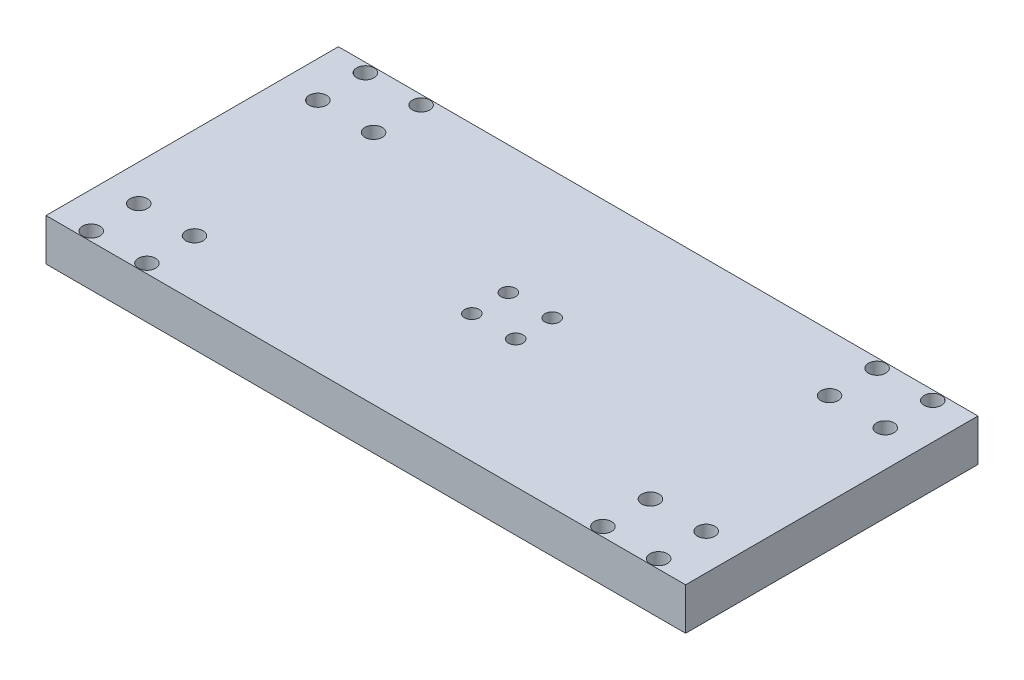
ISO-10303-21;
HEADER;
FILE_DESCRIPTION(('STEP AP214'),'2;1');
FILE_NAME('part.step','',(''),(''),'','','');
FILE_SCHEMA(('AUTOMOTIVE_DESIGN { 1 0 10303 214 1 1 1 1 }'));
ENDSEC;
DATA;
#1=APPLICATION_CONTEXT('core data for automotive mechanical design processes');
#2=APPLICATION_PROTOCOL_DEFINITION('international standard','automotive_design',2000,#1);
#3=PRODUCT_CONTEXT('',#1,'mechanical');
#4=PRODUCT('Part','Part','',(#3));
#5=PRODUCT_RELATED_PRODUCT_CATEGORY('part','',(#4));
#6=PRODUCT_DEFINITION_FORMATION('','',#4);
#7=PRODUCT_DEFINITION_CONTEXT('part definition',#1,'design');
#8=PRODUCT_DEFINITION('design','',#6,#7);
#9=PRODUCT_DEFINITION_SHAPE('','',#8);
#10=(LENGTH_UNIT() NAMED_UNIT(*) SI_UNIT(.MILLI.,.METRE.));
#11=(NAMED_UNIT(*) PLANE_ANGLE_UNIT() SI_UNIT($,.RADIAN.));
#12=(NAMED_UNIT(*) SI_UNIT($,.STERADIAN.) SOLID_ANGLE_UNIT());
#13=UNCERTAINTY_MEASURE_WITH_UNIT(LENGTH_MEASURE(1.E-05),#10,'distance_accuracy_value','');
#14=(GEOMETRIC_REPRESENTATION_CONTEXT(3) GLOBAL_UNCERTAINTY_ASSIGNED_CONTEXT((#13)) GLOBAL_UNIT_ASSIGNED_CONTEXT((#10,
#11,#12)) REPRESENTATION_CONTEXT('',''));
#15=CARTESIAN_POINT('',(0.,0.,0.));
#16=DIRECTION('',(0.,0.,1.));
#17=DIRECTION('',(1.,0.,0.));
#18=AXIS2_PLACEMENT_3D('',#15,#16,#17);
#19=CARTESIAN_POINT('',(0.,23.,0.));
#20=DIRECTION('',(0.,-1.,0.));
#21=DIRECTION('',(0.,0.,-1.));
#22=AXIS2_PLACEMENT_3D('',#19,#20,#21);
#23=PLANE('',#22);
#24=CARTESIAN_POINT('',(187.,23.,-90.0000000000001));
#25=DIRECTION('',(0.,1.,0.));
#26=DIRECTION('',(0.,0.,1.));
#27=AXIS2_PLACEMENT_3D('',#24,#25,#26);
#28=CIRCLE('',#27,3.99999999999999);
#29=CARTESIAN_POINT('',(187.,23.,-86.0000000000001));
#30=VERTEX_POINT('',#29);
#31=EDGE_CURVE('E238',#30,#30,#28,.T.);
#32=ORIENTED_EDGE('',*,*,#31,.F.);
#33=EDGE_LOOP('',(#32));
#34=FACE_BOUND('',#33,.T.);
#35=CARTESIAN_POINT('',(163.,23.,-70.));
#36=DIRECTION('',(0.,1.,0.));
#37=DIRECTION('',(0.,0.,1.));
#38=AXIS2_PLACEMENT_3D('',#35,#36,#37);
#39=CIRCLE('',#38,3.99999999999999);
#40=CARTESIAN_POINT('',(163.,23.,-66.0000000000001));
#41=VERTEX_POINT('',#40);
#42=EDGE_CURVE('E232',#41,#41,#39,.T.);
#43=ORIENTED_EDGE('',*,*,#42,.F.);
#44=EDGE_LOOP('',(#43));
#45=FACE_BOUND('',#44,.T.);
#46=CARTESIAN_POINT('',(187.,23.,-70.));
#47=DIRECTION('',(0.,1.,0.));
#48=DIRECTION('',(0.,0.,1.));
#49=AXIS2_PLACEMENT_3D('',#46,#47,#48);
#50=CIRCLE('',#49,3.99999999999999);
#51=CARTESIAN_POINT('',(187.,23.,-66.0000000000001));
#52=VERTEX_POINT('',#51);
#53=EDGE_CURVE('E226',#52,#52,#50,.T.);
#54=ORIENTED_EDGE('',*,*,#53,.F.);
#55=EDGE_LOOP('',(#54));
#56=FACE_BOUND('',#55,.T.);
#57=CARTESIAN_POINT('',(163.,23.,-90.0000000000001));
#58=DIRECTION('',(0.,1.,0.));
#59=DIRECTION('',(0.,0.,1.));
#60=AXIS2_PLACEMENT_3D('',#57,#58,#59);
#61=CIRCLE('',#60,3.99999999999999);
#62=CARTESIAN_POINT('',(163.,23.,-86.0000000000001));
#63=VERTEX_POINT('',#62);
#64=EDGE_CURVE('E220',#63,#63,#61,.T.);
#65=ORIENTED_EDGE('',*,*,#64,.F.);
#66=EDGE_LOOP('',(#65));
#67=FACE_BOUND('',#66,.T.);
#68=DIRECTION('',(0.,0.,1.));
#69=VECTOR('',#68,1.);
#70=CARTESIAN_POINT('',(0.,23.,0.));
#71=LINE('',#70,#69);
#72=CARTESIAN_POINT('',(0.,23.,-160.));
#73=VERTEX_POINT('',#72);
#74=CARTESIAN_POINT('',(0.,23.,0.));
#75=VERTEX_POINT('',#74);
#76=EDGE_CURVE('E97',#73,#75,#71,.T.);
#77=ORIENTED_EDGE('',*,*,#76,.T.);
#78=DIRECTION('',(1.,0.,0.));
#79=VECTOR('',#78,1.);
#80=CARTESIAN_POINT('',(0.,23.,0.));
#81=LINE('',#80,#79);
#82=CARTESIAN_POINT('',(350.,23.,0.));
#83=VERTEX_POINT('',#82);
#84=EDGE_CURVE('E92',#75,#83,#81,.T.);
#85=ORIENTED_EDGE('',*,*,#84,.T.);
#86=DIRECTION('',(0.,0.,-1.));
#87=VECTOR('',#86,1.);
#88=CARTESIAN_POINT('',(350.,23.,0.));
#89=LINE('',#88,#87);
#90=CARTESIAN_POINT('',(350.,23.,-160.));
#91=VERTEX_POINT('',#90);
#92=EDGE_CURVE('E95',#83,#91,#89,.T.);
#93=ORIENTED_EDGE('',*,*,#92,.T.);
#94=DIRECTION('',(-1.,0.,0.));
#95=VECTOR('',#94,1.);
#96=CARTESIAN_POINT('',(0.,23.,-160.));
#97=LINE('',#96,#95);
#98=EDGE_CURVE('E62',#91,#73,#97,.T.);
#99=ORIENTED_EDGE('',*,*,#98,.T.);
#100=EDGE_LOOP('',(#77,#85,#93,#99));
#101=FACE_BOUND('',#100,.T.);
#102=CARTESIAN_POINT('',(19.7499999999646,23.,-155.));
#103=DIRECTION('',(0.,1.,0.));
#104=DIRECTION('',(0.,0.,1.));
#105=AXIS2_PLACEMENT_3D('',#102,#103,#104);
#106=CIRCLE('',#105,4.75);
#107=CARTESIAN_POINT('',(19.7499999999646,23.,-150.25));
#108=VERTEX_POINT('',#107);
#109=EDGE_CURVE('E112',#108,#108,#106,.T.);
#110=ORIENTED_EDGE('',*,*,#109,.F.);
#111=EDGE_LOOP('',(#110));
#112=FACE_BOUND('',#111,.T.);
#113=CARTESIAN_POINT('',(50.2499999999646,23.,-155.));
#114=DIRECTION('',(0.,1.,0.));
#115=DIRECTION('',(0.,0.,1.));
#116=AXIS2_PLACEMENT_3D('',#113,#114,#115);
#117=CIRCLE('',#116,4.75);
#118=CARTESIAN_POINT('',(50.2499999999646,23.,-150.25));
#119=VERTEX_POINT('',#118);
#120=EDGE_CURVE('E127',#119,#119,#117,.T.);
#121=ORIENTED_EDGE('',*,*,#120,.F.);
#122=EDGE_LOOP('',(#121));
#123=FACE_BOUND('',#122,.T.);
#124=CARTESIAN_POINT('',(50.2499999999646,23.,-129.));
#125=DIRECTION('',(0.,1.,0.));
#126=DIRECTION('',(0.,0.,1.));
#127=AXIS2_PLACEMENT_3D('',#124,#125,#126);
#128=CIRCLE('',#127,4.75);
#129=CARTESIAN_POINT('',(50.2499999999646,23.,-124.25));
#130=VERTEX_POINT('',#129);
#131=EDGE_CURVE('E133',#130,#130,#128,.T.);
#132=ORIENTED_EDGE('',*,*,#131,.F.);
#133=EDGE_LOOP('',(#132));
#134=FACE_BOUND('',#133,.T.);
#135=CARTESIAN_POINT('',(19.7499999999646,23.,-129.));
#136=DIRECTION('',(0.,1.,0.));
#137=DIRECTION('',(0.,0.,1.));
#138=AXIS2_PLACEMENT_3D('',#135,#136,#137);
#139=CIRCLE('',#138,4.75);
#140=CARTESIAN_POINT('',(19.7499999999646,23.,-124.25));
#141=VERTEX_POINT('',#140);
#142=EDGE_CURVE('E139',#141,#141,#139,.T.);
#143=ORIENTED_EDGE('',*,*,#142,.F.);
#144=EDGE_LOOP('',(#143));
#145=FACE_BOUND('',#144,.T.);
#146=CARTESIAN_POINT('',(299.749999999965,23.,-155.));
#147=DIRECTION('',(0.,1.,0.));
#148=DIRECTION('',(0.,0.,1.));
#149=AXIS2_PLACEMENT_3D('',#146,#147,#148);
#150=CIRCLE('',#149,4.74999999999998);
#151=CARTESIAN_POINT('',(299.749999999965,23.,-150.25));
#152=VERTEX_POINT('',#151);
#153=EDGE_CURVE('E145',#152,#152,#150,.T.);
#154=ORIENTED_EDGE('',*,*,#153,.F.);
#155=EDGE_LOOP('',(#154));
#156=FACE_BOUND('',#155,.T.);
#157=CARTESIAN_POINT('',(330.249999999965,23.,-155.));
#158=DIRECTION('',(0.,1.,0.));
#159=DIRECTION('',(0.,0.,1.));
#160=AXIS2_PLACEMENT_3D('',#157,#158,#159);
#161=CIRCLE('',#160,4.74999999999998);
#162=CARTESIAN_POINT('',(330.249999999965,23.,-150.25));
#163=VERTEX_POINT('',#162);
#164=EDGE_CURVE('E151',#163,#163,#161,.T.);
#165=ORIENTED_EDGE('',*,*,#164,.F.);
#166=EDGE_LOOP('',(#165));
#167=FACE_BOUND('',#166,.T.);
#168=CARTESIAN_POINT('',(330.249999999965,23.,-129.));
#169=DIRECTION('',(0.,1.,0.));
#170=DIRECTION('',(0.,0.,1.));
#171=AXIS2_PLACEMENT_3D('',#168,#169,#170);
#172=CIRCLE('',#171,4.74999999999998);
#173=CARTESIAN_POINT('',(330.249999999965,23.,-124.25));
#174=VERTEX_POINT('',#173);
#175=EDGE_CURVE('E157',#174,#174,#172,.T.);
#176=ORIENTED_EDGE('',*,*,#175,.F.);
#177=EDGE_LOOP('',(#176));
#178=FACE_BOUND('',#177,.T.);
#179=CARTESIAN_POINT('',(299.749999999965,23.,-129.));
#180=DIRECTION('',(0.,1.,0.));
#181=DIRECTION('',(0.,0.,1.));
#182=AXIS2_PLACEMENT_3D('',#179,#180,#181);
#183=CIRCLE('',#182,4.74999999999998);
#184=CARTESIAN_POINT('',(299.749999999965,23.,-124.25));
#185=VERTEX_POINT('',#184);
#186=EDGE_CURVE('E163',#185,#185,#183,.T.);
#187=ORIENTED_EDGE('',*,*,#186,.F.);
#188=EDGE_LOOP('',(#187));
#189=FACE_BOUND('',#188,.T.);
#190=CARTESIAN_POINT('',(299.749999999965,23.,-31.));
#191=DIRECTION('',(0.,1.,0.));
#192=DIRECTION('',(0.,0.,-1.));
#193=AXIS2_PLACEMENT_3D('',#190,#191,#192);
#194=CIRCLE('',#193,4.74999999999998);
#195=CARTESIAN_POINT('',(299.749999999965,23.,-35.75));
#196=VERTEX_POINT('',#195);
#197=EDGE_CURVE('E169',#196,#196,#194,.T.);
#198=ORIENTED_EDGE('',*,*,#197,.F.);
#199=EDGE_LOOP('',(#198));
#200=FACE_BOUND('',#199,.T.);
#201=CARTESIAN_POINT('',(330.249999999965,23.,-31.));
#202=DIRECTION('',(0.,1.,0.));
#203=DIRECTION('',(0.,0.,-1.));
#204=AXIS2_PLACEMENT_3D('',#201,#202,#203);
#205=CIRCLE('',#204,4.74999999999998);
#206=CARTESIAN_POINT('',(330.249999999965,23.,-35.75));
#207=VERTEX_POINT('',#206);
#208=EDGE_CURVE('E175',#207,#207,#205,.T.);
#209=ORIENTED_EDGE('',*,*,#208,.F.);
#210=EDGE_LOOP('',(#209));
#211=FACE_BOUND('',#210,.T.);
#212=CARTESIAN_POINT('',(330.249999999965,23.,-5.));
#213=DIRECTION('',(0.,1.,0.));
#214=DIRECTION('',(0.,0.,-1.));
#215=AXIS2_PLACEMENT_3D('',#212,#213,#214);
#216=CIRCLE('',#215,4.74999999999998);
#217=CARTESIAN_POINT('',(330.249999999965,23.,-9.74999999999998));
#218=VERTEX_POINT('',#217);
#219=EDGE_CURVE('E181',#218,#218,#216,.T.);
#220=ORIENTED_EDGE('',*,*,#219,.F.);
#221=EDGE_LOOP('',(#220));
#222=FACE_BOUND('',#221,.T.);
#223=CARTESIAN_POINT('',(299.749999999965,23.,-5.));
#224=DIRECTION('',(0.,1.,0.));
#225=DIRECTION('',(0.,0.,-1.));
#226=AXIS2_PLACEMENT_3D('',#223,#224,#225);
#227=CIRCLE('',#226,4.74999999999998);
#228=CARTESIAN_POINT('',(299.749999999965,23.,-9.74999999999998));
#229=VERTEX_POINT('',#228);
#230=EDGE_CURVE('E187',#229,#229,#227,.T.);
#231=ORIENTED_EDGE('',*,*,#230,.F.);
#232=EDGE_LOOP('',(#231));
#233=FACE_BOUND('',#232,.T.);
#234=CARTESIAN_POINT('',(19.7499999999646,23.,-31.));
#235=DIRECTION('',(0.,1.,0.));
#236=DIRECTION('',(0.,0.,-1.));
#237=AXIS2_PLACEMENT_3D('',#234,#235,#236);
#238=CIRCLE('',#237,4.75);
#239=CARTESIAN_POINT('',(19.7499999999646,23.,-35.75));
#240=VERTEX_POINT('',#239);
#241=EDGE_CURVE('E193',#240,#240,#238,.T.);
#242=ORIENTED_EDGE('',*,*,#241,.F.);
#243=EDGE_LOOP('',(#242));
#244=FACE_BOUND('',#243,.T.);
#245=CARTESIAN_POINT('',(50.2499999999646,23.,-31.));
#246=DIRECTION('',(0.,1.,0.));
#247=DIRECTION('',(0.,0.,-1.));
#248=AXIS2_PLACEMENT_3D('',#245,#246,#247);
#249=CIRCLE('',#248,4.75);
#250=CARTESIAN_POINT('',(50.2499999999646,23.,-35.75));
#251=VERTEX_POINT('',#250);
#252=EDGE_CURVE('E199',#251,#251,#249,.T.);
#253=ORIENTED_EDGE('',*,*,#252,.F.);
#254=EDGE_LOOP('',(#253));
#255=FACE_BOUND('',#254,.T.);
#256=CARTESIAN_POINT('',(50.2499999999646,23.,-5.));
#257=DIRECTION('',(0.,1.,0.));
#258=DIRECTION('',(0.,0.,-1.));
#259=AXIS2_PLACEMENT_3D('',#256,#257,#258);
#260=CIRCLE('',#259,4.75);
#261=CARTESIAN_POINT('',(50.2499999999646,23.,-9.75));
#262=VERTEX_POINT('',#261);
#263=EDGE_CURVE('E205',#262,#262,#260,.T.);
#264=ORIENTED_EDGE('',*,*,#263,.F.);
#265=EDGE_LOOP('',(#264));
#266=FACE_BOUND('',#265,.T.);
#267=CARTESIAN_POINT('',(19.7499999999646,23.,-5.));
#268=DIRECTION('',(0.,1.,0.));
#269=DIRECTION('',(0.,0.,-1.));
#270=AXIS2_PLACEMENT_3D('',#267,#268,#269);
#271=CIRCLE('',#270,4.75);
#272=CARTESIAN_POINT('',(19.7499999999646,23.,-9.75000000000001));
#273=VERTEX_POINT('',#272);
#274=EDGE_CURVE('E211',#273,#273,#271,.T.);
#275=ORIENTED_EDGE('',*,*,#274,.F.);
#276=EDGE_LOOP('',(#275));
#277=FACE_BOUND('',#276,.T.);
#278=ADVANCED_FACE('F45',(#34,#45,#56,#67,#101,#112,#123,#134,#145,#156,#167,#178,#189,#200,
#211,#222,#233,#244,#255,#266,#277),#23,.F.);
#279=CARTESIAN_POINT('',(0.,0.,0.));
#280=DIRECTION('',(0.,-1.,0.));
#281=DIRECTION('',(0.,0.,-1.));
#282=AXIS2_PLACEMENT_3D('',#279,#280,#281);
#283=PLANE('',#282);
#284=CARTESIAN_POINT('',(50.2499999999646,0.,-5.));
#285=DIRECTION('',(0.,1.,0.));
#286=DIRECTION('',(0.,0.,-1.));
#287=AXIS2_PLACEMENT_3D('',#284,#285,#286);
#288=CIRCLE('',#287,4.75);
#289=CARTESIAN_POINT('',(50.2499999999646,0.,-9.75));
#290=VERTEX_POINT('',#289);
#291=EDGE_CURVE('E208',#290,#290,#288,.T.);
#292=ORIENTED_EDGE('',*,*,#291,.T.);
#293=EDGE_LOOP('',(#292));
#294=FACE_BOUND('',#293,.T.);
#295=CARTESIAN_POINT('',(19.7499999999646,0.,-31.));
#296=DIRECTION('',(0.,1.,0.));
#297=DIRECTION('',(0.,0.,-1.));
#298=AXIS2_PLACEMENT_3D('',#295,#296,#297);
#299=CIRCLE('',#298,4.75);
#300=CARTESIAN_POINT('',(19.7499999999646,0.,-35.75));
#301=VERTEX_POINT('',#300);
#302=EDGE_CURVE('E196',#301,#301,#299,.T.);
#303=ORIENTED_EDGE('',*,*,#302,.T.);
#304=EDGE_LOOP('',(#303));
#305=FACE_BOUND('',#304,.T.);
#306=CARTESIAN_POINT('',(330.249999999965,0.,-5.));
#307=DIRECTION('',(0.,1.,0.));
#308=DIRECTION('',(0.,0.,-1.));
#309=AXIS2_PLACEMENT_3D('',#306,#307,#308);
#310=CIRCLE('',#309,4.74999999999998);
#311=CARTESIAN_POINT('',(330.249999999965,0.,-9.74999999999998));
#312=VERTEX_POINT('',#311);
#313=EDGE_CURVE('E184',#312,#312,#310,.T.);
#314=ORIENTED_EDGE('',*,*,#313,.T.);
#315=EDGE_LOOP('',(#314));
#316=FACE_BOUND('',#315,.T.);
#317=CARTESIAN_POINT('',(299.749999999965,0.,-31.));
#318=DIRECTION('',(0.,1.,0.));
#319=DIRECTION('',(0.,0.,-1.));
#320=AXIS2_PLACEMENT_3D('',#317,#318,#319);
#321=CIRCLE('',#320,4.74999999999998);
#322=CARTESIAN_POINT('',(299.749999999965,0.,-35.75));
#323=VERTEX_POINT('',#322);
#324=EDGE_CURVE('E172',#323,#323,#321,.T.);
#325=ORIENTED_EDGE('',*,*,#324,.T.);
#326=EDGE_LOOP('',(#325));
#327=FACE_BOUND('',#326,.T.);
#328=CARTESIAN_POINT('',(330.249999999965,0.,-129.));
#329=DIRECTION('',(0.,1.,0.));
#330=DIRECTION('',(0.,0.,1.));
#331=AXIS2_PLACEMENT_3D('',#328,#329,#330);
#332=CIRCLE('',#331,4.74999999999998);
#333=CARTESIAN_POINT('',(330.249999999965,0.,-124.25));
#334=VERTEX_POINT('',#333);
#335=EDGE_CURVE('E160',#334,#334,#332,.T.);
#336=ORIENTED_EDGE('',*,*,#335,.T.);
#337=EDGE_LOOP('',(#336));
#338=FACE_BOUND('',#337,.T.);
#339=CARTESIAN_POINT('',(299.749999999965,0.,-155.));
#340=DIRECTION('',(0.,1.,0.));
#341=DIRECTION('',(0.,0.,1.));
#342=AXIS2_PLACEMENT_3D('',#339,#340,#341);
#343=CIRCLE('',#342,4.74999999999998);
#344=CARTESIAN_POINT('',(299.749999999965,0.,-150.25));
#345=VERTEX_POINT('',#344);
#346=EDGE_CURVE('E148',#345,#345,#343,.T.);
#347=ORIENTED_EDGE('',*,*,#346,.T.);
#348=EDGE_LOOP('',(#347));
#349=FACE_BOUND('',#348,.T.);
#350=CARTESIAN_POINT('',(50.2499999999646,0.,-129.));
#351=DIRECTION('',(0.,1.,0.));
#352=DIRECTION('',(0.,0.,1.));
#353=AXIS2_PLACEMENT_3D('',#350,#351,#352);
#354=CIRCLE('',#353,4.75);
#355=CARTESIAN_POINT('',(50.2499999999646,0.,-124.25));
#356=VERTEX_POINT('',#355);
#357=EDGE_CURVE('E136',#356,#356,#354,.T.);
#358=ORIENTED_EDGE('',*,*,#357,.T.);
#359=EDGE_LOOP('',(#358));
#360=FACE_BOUND('',#359,.T.);
#361=CARTESIAN_POINT('',(19.7499999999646,0.,-155.));
#362=DIRECTION('',(0.,1.,0.));
#363=DIRECTION('',(0.,0.,1.));
#364=AXIS2_PLACEMENT_3D('',#361,#362,#363);
#365=CIRCLE('',#364,4.75);
#366=CARTESIAN_POINT('',(19.7499999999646,0.,-150.25));
#367=VERTEX_POINT('',#366);
#368=EDGE_CURVE('E124',#367,#367,#365,.T.);
#369=ORIENTED_EDGE('',*,*,#368,.T.);
#370=EDGE_LOOP('',(#369));
#371=FACE_BOUND('',#370,.T.);
#372=DIRECTION('',(0.,0.,1.));
#373=VECTOR('',#372,1.);
#374=CARTESIAN_POINT('',(0.,0.,0.));
#375=LINE('',#374,#373);
#376=CARTESIAN_POINT('',(0.,0.,-160.));
#377=VERTEX_POINT('',#376);
#378=CARTESIAN_POINT('',(0.,0.,0.));
#379=VERTEX_POINT('',#378);
#380=EDGE_CURVE('E109',#377,#379,#375,.T.);
#381=ORIENTED_EDGE('',*,*,#380,.F.);
#382=DIRECTION('',(-1.,0.,0.));
#383=VECTOR('',#382,1.);
#384=CARTESIAN_POINT('',(0.,0.,-160.));
#385=LINE('',#384,#383);
#386=CARTESIAN_POINT('',(350.,0.,-160.));
#387=VERTEX_POINT('',#386);
#388=EDGE_CURVE('E85',#387,#377,#385,.T.);
#389=ORIENTED_EDGE('',*,*,#388,.F.);
#390=DIRECTION('',(0.,0.,-1.));
#391=VECTOR('',#390,1.);
#392=CARTESIAN_POINT('',(350.,0.,0.));
#393=LINE('',#392,#391);
#394=CARTESIAN_POINT('',(350.,0.,0.));
#395=VERTEX_POINT('',#394);
#396=EDGE_CURVE('E79',#395,#387,#393,.T.);
#397=ORIENTED_EDGE('',*,*,#396,.F.);
#398=DIRECTION('',(1.,0.,0.));
#399=VECTOR('',#398,1.);
#400=CARTESIAN_POINT('',(0.,0.,0.));
#401=LINE('',#400,#399);
#402=EDGE_CURVE('E101',#379,#395,#401,.T.);
#403=ORIENTED_EDGE('',*,*,#402,.F.);
#404=EDGE_LOOP('',(#381,#389,#397,#403));
#405=FACE_BOUND('',#404,.T.);
#406=CARTESIAN_POINT('',(50.2499999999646,0.,-155.));
#407=DIRECTION('',(0.,1.,0.));
#408=DIRECTION('',(0.,0.,1.));
#409=AXIS2_PLACEMENT_3D('',#406,#407,#408);
#410=CIRCLE('',#409,4.75);
#411=CARTESIAN_POINT('',(50.2499999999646,0.,-150.25));
#412=VERTEX_POINT('',#411);
#413=EDGE_CURVE('E130',#412,#412,#410,.T.);
#414=ORIENTED_EDGE('',*,*,#413,.T.);
#415=EDGE_LOOP('',(#414));
#416=FACE_BOUND('',#415,.T.);
#417=CARTESIAN_POINT('',(19.7499999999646,0.,-129.));
#418=DIRECTION('',(0.,1.,0.));
#419=DIRECTION('',(0.,0.,1.));
#420=AXIS2_PLACEMENT_3D('',#417,#418,#419);
#421=CIRCLE('',#420,4.75);
#422=CARTESIAN_POINT('',(19.7499999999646,0.,-124.25));
#423=VERTEX_POINT('',#422);
#424=EDGE_CURVE('E142',#423,#423,#421,.T.);
#425=ORIENTED_EDGE('',*,*,#424,.T.);
#426=EDGE_LOOP('',(#425));
#427=FACE_BOUND('',#426,.T.);
#428=CARTESIAN_POINT('',(330.249999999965,0.,-155.));
#429=DIRECTION('',(0.,1.,0.));
#430=DIRECTION('',(0.,0.,1.));
#431=AXIS2_PLACEMENT_3D('',#428,#429,#430);
#432=CIRCLE('',#431,4.74999999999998);
#433=CARTESIAN_POINT('',(330.249999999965,0.,-150.25));
#434=VERTEX_POINT('',#433);
#435=EDGE_CURVE('E154',#434,#434,#432,.T.);
#436=ORIENTED_EDGE('',*,*,#435,.T.);
#437=EDGE_LOOP('',(#436));
#438=FACE_BOUND('',#437,.T.);
#439=CARTESIAN_POINT('',(299.749999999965,0.,-129.));
#440=DIRECTION('',(0.,1.,0.));
#441=DIRECTION('',(0.,0.,1.));
#442=AXIS2_PLACEMENT_3D('',#439,#440,#441);
#443=CIRCLE('',#442,4.74999999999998);
#444=CARTESIAN_POINT('',(299.749999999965,0.,-124.25));
#445=VERTEX_POINT('',#444);
#446=EDGE_CURVE('E166',#445,#445,#443,.T.);
#447=ORIENTED_EDGE('',*,*,#446,.T.);
#448=EDGE_LOOP('',(#447));
#449=FACE_BOUND('',#448,.T.);
#450=CARTESIAN_POINT('',(330.249999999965,0.,-31.));
#451=DIRECTION('',(0.,1.,0.));
#452=DIRECTION('',(0.,0.,-1.));
#453=AXIS2_PLACEMENT_3D('',#450,#451,#452);
#454=CIRCLE('',#453,4.74999999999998);
#455=CARTESIAN_POINT('',(330.249999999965,0.,-35.75));
#456=VERTEX_POINT('',#455);
#457=EDGE_CURVE('E178',#456,#456,#454,.T.);
#458=ORIENTED_EDGE('',*,*,#457,.T.);
#459=EDGE_LOOP('',(#458));
#460=FACE_BOUND('',#459,.T.);
#461=CARTESIAN_POINT('',(299.749999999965,0.,-5.));
#462=DIRECTION('',(0.,1.,0.));
#463=DIRECTION('',(0.,0.,-1.));
#464=AXIS2_PLACEMENT_3D('',#461,#462,#463);
#465=CIRCLE('',#464,4.74999999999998);
#466=CARTESIAN_POINT('',(299.749999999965,0.,-9.74999999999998));
#467=VERTEX_POINT('',#466);
#468=EDGE_CURVE('E190',#467,#467,#465,.T.);
#469=ORIENTED_EDGE('',*,*,#468,.T.);
#470=EDGE_LOOP('',(#469));
#471=FACE_BOUND('',#470,.T.);
#472=CARTESIAN_POINT('',(50.2499999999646,0.,-31.));
#473=DIRECTION('',(0.,1.,0.));
#474=DIRECTION('',(0.,0.,-1.));
#475=AXIS2_PLACEMENT_3D('',#472,#473,#474);
#476=CIRCLE('',#475,4.75);
#477=CARTESIAN_POINT('',(50.2499999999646,0.,-35.75));
#478=VERTEX_POINT('',#477);
#479=EDGE_CURVE('E202',#478,#478,#476,.T.);
#480=ORIENTED_EDGE('',*,*,#479,.T.);
#481=EDGE_LOOP('',(#480));
#482=FACE_BOUND('',#481,.T.);
#483=CARTESIAN_POINT('',(19.7499999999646,0.,-5.));
#484=DIRECTION('',(0.,1.,0.));
#485=DIRECTION('',(0.,0.,-1.));
#486=AXIS2_PLACEMENT_3D('',#483,#484,#485);
#487=CIRCLE('',#486,4.75);
#488=CARTESIAN_POINT('',(19.7499999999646,0.,-9.75000000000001));
#489=VERTEX_POINT('',#488);
#490=EDGE_CURVE('E214',#489,#489,#487,.T.);
#491=ORIENTED_EDGE('',*,*,#490,.T.);
#492=EDGE_LOOP('',(#491));
#493=FACE_BOUND('',#492,.T.);
#494=ADVANCED_FACE('F120',(#294,#305,#316,#327,#338,#349,#360,#371,#405,#416,#427,#438,#449,
#460,#471,#482,#493),#283,.T.);
#495=CARTESIAN_POINT('',(0.,23.,0.));
#496=DIRECTION('',(1.,0.,0.));
#497=DIRECTION('',(0.,0.,-1.));
#498=AXIS2_PLACEMENT_3D('',#495,#496,#497);
#499=PLANE('',#498);
#500=ORIENTED_EDGE('',*,*,#380,.T.);
#501=DIRECTION('',(0.,-1.,0.));
#502=VECTOR('',#501,1.);
#503=CARTESIAN_POINT('',(0.,23.,0.));
#504=LINE('',#503,#502);
#505=EDGE_CURVE('E11',#75,#379,#504,.T.);
#506=ORIENTED_EDGE('',*,*,#505,.F.);
#507=ORIENTED_EDGE('',*,*,#76,.F.);
#508=DIRECTION('',(0.,-1.,0.));
#509=VECTOR('',#508,1.);
#510=CARTESIAN_POINT('',(0.,23.,-160.));
#511=LINE('',#510,#509);
#512=EDGE_CURVE('E105',#73,#377,#511,.T.);
#513=ORIENTED_EDGE('',*,*,#512,.T.);
#514=EDGE_LOOP('',(#500,#506,#507,#513));
#515=FACE_BOUND('',#514,.T.);
#516=ADVANCED_FACE('F47',(#515),#499,.F.);
#517=CARTESIAN_POINT('',(0.,23.,0.));
#518=DIRECTION('',(0.,0.,-1.));
#519=DIRECTION('',(-1.,0.,0.));
#520=AXIS2_PLACEMENT_3D('',#517,#518,#519);
#521=PLANE('',#520);
#522=ORIENTED_EDGE('',*,*,#402,.T.);
#523=DIRECTION('',(0.,-1.,0.));
#524=VECTOR('',#523,1.);
#525=CARTESIAN_POINT('',(350.,23.,0.));
#526=LINE('',#525,#524);
#527=EDGE_CURVE('E54',#83,#395,#526,.T.);
#528=ORIENTED_EDGE('',*,*,#527,.F.);
#529=ORIENTED_EDGE('',*,*,#84,.F.);
#530=ORIENTED_EDGE('',*,*,#505,.T.);
#531=EDGE_LOOP('',(#522,#528,#529,#530));
#532=FACE_BOUND('',#531,.T.);
#533=ADVANCED_FACE('F100',(#532),#521,.F.);
#534=CARTESIAN_POINT('',(350.,23.,0.));
#535=DIRECTION('',(-1.,0.,0.));
#536=DIRECTION('',(0.,0.,1.));
#537=AXIS2_PLACEMENT_3D('',#534,#535,#536);
#538=PLANE('',#537);
#539=ORIENTED_EDGE('',*,*,#396,.T.);
#540=DIRECTION('',(0.,-1.,0.));
#541=VECTOR('',#540,1.);
#542=CARTESIAN_POINT('',(350.,23.,-160.));
#543=LINE('',#542,#541);
#544=EDGE_CURVE('E102',#91,#387,#543,.T.);
#545=ORIENTED_EDGE('',*,*,#544,.F.);
#546=ORIENTED_EDGE('',*,*,#92,.F.);
#547=ORIENTED_EDGE('',*,*,#527,.T.);
#548=EDGE_LOOP('',(#539,#545,#546,#547));
#549=FACE_BOUND('',#548,.T.);
#550=ADVANCED_FACE('F103',(#549),#538,.F.);
#551=CARTESIAN_POINT('',(0.,23.,-160.));
#552=DIRECTION('',(0.,0.,1.));
#553=DIRECTION('',(1.,0.,0.));
#554=AXIS2_PLACEMENT_3D('',#551,#552,#553);
#555=PLANE('',#554);
#556=ORIENTED_EDGE('',*,*,#388,.T.);
#557=ORIENTED_EDGE('',*,*,#512,.F.);
#558=ORIENTED_EDGE('',*,*,#98,.F.);
#559=ORIENTED_EDGE('',*,*,#544,.T.);
#560=EDGE_LOOP('',(#556,#557,#558,#559));
#561=FACE_BOUND('',#560,.T.);
#562=ADVANCED_FACE('F117',(#561),#555,.F.);
#563=CARTESIAN_POINT('',(19.7499999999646,23.,-155.));
#564=DIRECTION('',(0.,-1.,0.));
#565=DIRECTION('',(0.,0.,-1.));
#566=AXIS2_PLACEMENT_3D('',#563,#564,#565);
#567=CYLINDRICAL_SURFACE('',#566,4.75);
#568=ORIENTED_EDGE('',*,*,#109,.T.);
#569=EDGE_LOOP('',(#568));
#570=FACE_BOUND('',#569,.T.);
#571=ORIENTED_EDGE('',*,*,#368,.F.);
#572=EDGE_LOOP('',(#571));
#573=FACE_BOUND('',#572,.T.);
#574=ADVANCED_FACE('F335',(#570,#573),#567,.F.);
#575=CARTESIAN_POINT('',(50.2499999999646,23.,-155.));
#576=DIRECTION('',(0.,-1.,0.));
#577=DIRECTION('',(0.,0.,-1.));
#578=AXIS2_PLACEMENT_3D('',#575,#576,#577);
#579=CYLINDRICAL_SURFACE('',#578,4.75);
#580=ORIENTED_EDGE('',*,*,#120,.T.);
#581=EDGE_LOOP('',(#580));
#582=FACE_BOUND('',#581,.T.);
#583=ORIENTED_EDGE('',*,*,#413,.F.);
#584=EDGE_LOOP('',(#583));
#585=FACE_BOUND('',#584,.T.);
#586=ADVANCED_FACE('F331',(#582,#585),#579,.F.);
#587=CARTESIAN_POINT('',(50.2499999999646,23.,-129.));
#588=DIRECTION('',(0.,-1.,0.));
#589=DIRECTION('',(0.,0.,-1.));
#590=AXIS2_PLACEMENT_3D('',#587,#588,#589);
#591=CYLINDRICAL_SURFACE('',#590,4.75);
#592=ORIENTED_EDGE('',*,*,#131,.T.);
#593=EDGE_LOOP('',(#592));
#594=FACE_BOUND('',#593,.T.);
#595=ORIENTED_EDGE('',*,*,#357,.F.);
#596=EDGE_LOOP('',(#595));
#597=FACE_BOUND('',#596,.T.);
#598=ADVANCED_FACE('F327',(#594,#597),#591,.F.);
#599=CARTESIAN_POINT('',(19.7499999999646,23.,-129.));
#600=DIRECTION('',(0.,-1.,0.));
#601=DIRECTION('',(0.,0.,-1.));
#602=AXIS2_PLACEMENT_3D('',#599,#600,#601);
#603=CYLINDRICAL_SURFACE('',#602,4.75);
#604=ORIENTED_EDGE('',*,*,#142,.T.);
#605=EDGE_LOOP('',(#604));
#606=FACE_BOUND('',#605,.T.);
#607=ORIENTED_EDGE('',*,*,#424,.F.);
#608=EDGE_LOOP('',(#607));
#609=FACE_BOUND('',#608,.T.);
#610=ADVANCED_FACE('F323',(#606,#609),#603,.F.);
#611=CARTESIAN_POINT('',(299.749999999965,23.,-155.));
#612=DIRECTION('',(0.,-1.,0.));
#613=DIRECTION('',(0.,0.,-1.));
#614=AXIS2_PLACEMENT_3D('',#611,#612,#613);
#615=CYLINDRICAL_SURFACE('',#614,4.74999999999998);
#616=ORIENTED_EDGE('',*,*,#153,.T.);
#617=EDGE_LOOP('',(#616));
#618=FACE_BOUND('',#617,.T.);
#619=ORIENTED_EDGE('',*,*,#346,.F.);
#620=EDGE_LOOP('',(#619));
#621=FACE_BOUND('',#620,.T.);
#622=ADVANCED_FACE('F319',(#618,#621),#615,.F.);
#623=CARTESIAN_POINT('',(330.249999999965,23.,-155.));
#624=DIRECTION('',(0.,-1.,0.));
#625=DIRECTION('',(0.,0.,-1.));
#626=AXIS2_PLACEMENT_3D('',#623,#624,#625);
#627=CYLINDRICAL_SURFACE('',#626,4.74999999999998);
#628=ORIENTED_EDGE('',*,*,#164,.T.);
#629=EDGE_LOOP('',(#628));
#630=FACE_BOUND('',#629,.T.);
#631=ORIENTED_EDGE('',*,*,#435,.F.);
#632=EDGE_LOOP('',(#631));
#633=FACE_BOUND('',#632,.T.);
#634=ADVANCED_FACE('F315',(#630,#633),#627,.F.);
#635=CARTESIAN_POINT('',(330.249999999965,23.,-129.));
#636=DIRECTION('',(0.,-1.,0.));
#637=DIRECTION('',(0.,0.,-1.));
#638=AXIS2_PLACEMENT_3D('',#635,#636,#637);
#639=CYLINDRICAL_SURFACE('',#638,4.74999999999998);
#640=ORIENTED_EDGE('',*,*,#175,.T.);
#641=EDGE_LOOP('',(#640));
#642=FACE_BOUND('',#641,.T.);
#643=ORIENTED_EDGE('',*,*,#335,.F.);
#644=EDGE_LOOP('',(#643));
#645=FACE_BOUND('',#644,.T.);
#646=ADVANCED_FACE('F311',(#642,#645),#639,.F.);
#647=CARTESIAN_POINT('',(299.749999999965,23.,-129.));
#648=DIRECTION('',(0.,-1.,0.));
#649=DIRECTION('',(0.,0.,-1.));
#650=AXIS2_PLACEMENT_3D('',#647,#648,#649);
#651=CYLINDRICAL_SURFACE('',#650,4.74999999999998);
#652=ORIENTED_EDGE('',*,*,#186,.T.);
#653=EDGE_LOOP('',(#652));
#654=FACE_BOUND('',#653,.T.);
#655=ORIENTED_EDGE('',*,*,#446,.F.);
#656=EDGE_LOOP('',(#655));
#657=FACE_BOUND('',#656,.T.);
#658=ADVANCED_FACE('F307',(#654,#657),#651,.F.);
#659=CARTESIAN_POINT('',(299.749999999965,23.,-31.));
#660=DIRECTION('',(0.,-1.,0.));
#661=DIRECTION('',(0.,0.,-1.));
#662=AXIS2_PLACEMENT_3D('',#659,#660,#661);
#663=CYLINDRICAL_SURFACE('',#662,4.74999999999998);
#664=ORIENTED_EDGE('',*,*,#197,.T.);
#665=EDGE_LOOP('',(#664));
#666=FACE_BOUND('',#665,.T.);
#667=ORIENTED_EDGE('',*,*,#324,.F.);
#668=EDGE_LOOP('',(#667));
#669=FACE_BOUND('',#668,.T.);
#670=ADVANCED_FACE('F303',(#666,#669),#663,.F.);
#671=CARTESIAN_POINT('',(330.249999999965,23.,-31.));
#672=DIRECTION('',(0.,-1.,0.));
#673=DIRECTION('',(0.,0.,-1.));
#674=AXIS2_PLACEMENT_3D('',#671,#672,#673);
#675=CYLINDRICAL_SURFACE('',#674,4.74999999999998);
#676=ORIENTED_EDGE('',*,*,#208,.T.);
#677=EDGE_LOOP('',(#676));
#678=FACE_BOUND('',#677,.T.);
#679=ORIENTED_EDGE('',*,*,#457,.F.);
#680=EDGE_LOOP('',(#679));
#681=FACE_BOUND('',#680,.T.);
#682=ADVANCED_FACE('F299',(#678,#681),#675,.F.);
#683=CARTESIAN_POINT('',(330.249999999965,23.,-5.));
#684=DIRECTION('',(0.,-1.,0.));
#685=DIRECTION('',(0.,0.,-1.));
#686=AXIS2_PLACEMENT_3D('',#683,#684,#685);
#687=CYLINDRICAL_SURFACE('',#686,4.74999999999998);
#688=ORIENTED_EDGE('',*,*,#219,.T.);
#689=EDGE_LOOP('',(#688));
#690=FACE_BOUND('',#689,.T.);
#691=ORIENTED_EDGE('',*,*,#313,.F.);
#692=EDGE_LOOP('',(#691));
#693=FACE_BOUND('',#692,.T.);
#694=ADVANCED_FACE('F295',(#690,#693),#687,.F.);
#695=CARTESIAN_POINT('',(299.749999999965,23.,-5.));
#696=DIRECTION('',(0.,-1.,0.));
#697=DIRECTION('',(0.,0.,-1.));
#698=AXIS2_PLACEMENT_3D('',#695,#696,#697);
#699=CYLINDRICAL_SURFACE('',#698,4.74999999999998);
#700=ORIENTED_EDGE('',*,*,#230,.T.);
#701=EDGE_LOOP('',(#700));
#702=FACE_BOUND('',#701,.T.);
#703=ORIENTED_EDGE('',*,*,#468,.F.);
#704=EDGE_LOOP('',(#703));
#705=FACE_BOUND('',#704,.T.);
#706=ADVANCED_FACE('F291',(#702,#705),#699,.F.);
#707=CARTESIAN_POINT('',(19.7499999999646,23.,-31.));
#708=DIRECTION('',(0.,-1.,0.));
#709=DIRECTION('',(0.,0.,-1.));
#710=AXIS2_PLACEMENT_3D('',#707,#708,#709);
#711=CYLINDRICAL_SURFACE('',#710,4.75);
#712=ORIENTED_EDGE('',*,*,#241,.T.);
#713=EDGE_LOOP('',(#712));
#714=FACE_BOUND('',#713,.T.);
#715=ORIENTED_EDGE('',*,*,#302,.F.);
#716=EDGE_LOOP('',(#715));
#717=FACE_BOUND('',#716,.T.);
#718=ADVANCED_FACE('F287',(#714,#717),#711,.F.);
#719=CARTESIAN_POINT('',(50.2499999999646,23.,-31.));
#720=DIRECTION('',(0.,-1.,0.));
#721=DIRECTION('',(0.,0.,-1.));
#722=AXIS2_PLACEMENT_3D('',#719,#720,#721);
#723=CYLINDRICAL_SURFACE('',#722,4.75);
#724=ORIENTED_EDGE('',*,*,#252,.T.);
#725=EDGE_LOOP('',(#724));
#726=FACE_BOUND('',#725,.T.);
#727=ORIENTED_EDGE('',*,*,#479,.F.);
#728=EDGE_LOOP('',(#727));
#729=FACE_BOUND('',#728,.T.);
#730=ADVANCED_FACE('F283',(#726,#729),#723,.F.);
#731=CARTESIAN_POINT('',(50.2499999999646,23.,-5.));
#732=DIRECTION('',(0.,-1.,0.));
#733=DIRECTION('',(0.,0.,-1.));
#734=AXIS2_PLACEMENT_3D('',#731,#732,#733);
#735=CYLINDRICAL_SURFACE('',#734,4.75);
#736=ORIENTED_EDGE('',*,*,#263,.T.);
#737=EDGE_LOOP('',(#736));
#738=FACE_BOUND('',#737,.T.);
#739=ORIENTED_EDGE('',*,*,#291,.F.);
#740=EDGE_LOOP('',(#739));
#741=FACE_BOUND('',#740,.T.);
#742=ADVANCED_FACE('F275',(#738,#741),#735,.F.);
#743=CARTESIAN_POINT('',(19.7499999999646,23.,-5.));
#744=DIRECTION('',(0.,-1.,0.));
#745=DIRECTION('',(0.,0.,-1.));
#746=AXIS2_PLACEMENT_3D('',#743,#744,#745);
#747=CYLINDRICAL_SURFACE('',#746,4.75);
#748=ORIENTED_EDGE('',*,*,#274,.T.);
#749=EDGE_LOOP('',(#748));
#750=FACE_BOUND('',#749,.T.);
#751=ORIENTED_EDGE('',*,*,#490,.F.);
#752=EDGE_LOOP('',(#751));
#753=FACE_BOUND('',#752,.T.);
#754=ADVANCED_FACE('F265',(#750,#753),#747,.F.);
#755=CARTESIAN_POINT('',(163.,13.,-90.0000000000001));
#756=DIRECTION('',(0.,1.,0.));
#757=DIRECTION('',(0.,0.,1.));
#758=AXIS2_PLACEMENT_3D('',#755,#756,#757);
#759=CYLINDRICAL_SURFACE('',#758,3.99999999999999);
#760=CARTESIAN_POINT('',(163.,13.,-90.0000000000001));
#761=DIRECTION('',(0.,1.,0.));
#762=DIRECTION('',(0.,0.,1.));
#763=AXIS2_PLACEMENT_3D('',#760,#761,#762);
#764=CIRCLE('',#763,3.99999999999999);
#765=CARTESIAN_POINT('',(163.,13.,-86.0000000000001));
#766=VERTEX_POINT('',#765);
#767=EDGE_CURVE('E217',#766,#766,#764,.T.);
#768=ORIENTED_EDGE('',*,*,#767,.F.);
#769=EDGE_LOOP('',(#768));
#770=FACE_BOUND('',#769,.T.);
#771=ORIENTED_EDGE('',*,*,#64,.T.);
#772=EDGE_LOOP('',(#771));
#773=FACE_BOUND('',#772,.T.);
#774=ADVANCED_FACE('F262',(#770,#773),#759,.F.);
#775=CARTESIAN_POINT('',(163.,13.,-90.0000000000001));
#776=DIRECTION('',(0.,1.,0.));
#777=DIRECTION('',(0.,0.,1.));
#778=AXIS2_PLACEMENT_3D('',#775,#776,#777);
#779=PLANE('',#778);
#780=ORIENTED_EDGE('',*,*,#767,.T.);
#781=EDGE_LOOP('',(#780));
#782=FACE_BOUND('',#781,.T.);
#783=ADVANCED_FACE('F264',(#782),#779,.T.);
#784=CARTESIAN_POINT('',(187.,13.,-70.));
#785=DIRECTION('',(0.,1.,0.));
#786=DIRECTION('',(0.,0.,1.));
#787=AXIS2_PLACEMENT_3D('',#784,#785,#786);
#788=CYLINDRICAL_SURFACE('',#787,3.99999999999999);
#789=CARTESIAN_POINT('',(187.,13.,-70.));
#790=DIRECTION('',(0.,1.,0.));
#791=DIRECTION('',(0.,0.,1.));
#792=AXIS2_PLACEMENT_3D('',#789,#790,#791);
#793=CIRCLE('',#792,3.99999999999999);
#794=CARTESIAN_POINT('',(187.,13.,-66.0000000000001));
#795=VERTEX_POINT('',#794);
#796=EDGE_CURVE('E229',#795,#795,#793,.T.);
#797=ORIENTED_EDGE('',*,*,#796,.F.);
#798=EDGE_LOOP('',(#797));
#799=FACE_BOUND('',#798,.T.);
#800=ORIENTED_EDGE('',*,*,#53,.T.);
#801=EDGE_LOOP('',(#800));
#802=FACE_BOUND('',#801,.T.);
#803=ADVANCED_FACE('F271',(#799,#802),#788,.F.);
#804=CARTESIAN_POINT('',(187.,13.,-70.));
#805=DIRECTION('',(0.,1.,0.));
#806=DIRECTION('',(0.,0.,1.));
#807=AXIS2_PLACEMENT_3D('',#804,#805,#806);
#808=PLANE('',#807);
#809=ORIENTED_EDGE('',*,*,#796,.T.);
#810=EDGE_LOOP('',(#809));
#811=FACE_BOUND('',#810,.T.);
#812=ADVANCED_FACE('F494',(#811),#808,.T.);
#813=CARTESIAN_POINT('',(163.,13.,-70.));
#814=DIRECTION('',(0.,1.,0.));
#815=DIRECTION('',(0.,0.,1.));
#816=AXIS2_PLACEMENT_3D('',#813,#814,#815);
#817=CYLINDRICAL_SURFACE('',#816,3.99999999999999);
#818=CARTESIAN_POINT('',(163.,13.,-70.));
#819=DIRECTION('',(0.,1.,0.));
#820=DIRECTION('',(0.,0.,1.));
#821=AXIS2_PLACEMENT_3D('',#818,#819,#820);
#822=CIRCLE('',#821,3.99999999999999);
#823=CARTESIAN_POINT('',(163.,13.,-66.0000000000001));
#824=VERTEX_POINT('',#823);
#825=EDGE_CURVE('E235',#824,#824,#822,.T.);
#826=ORIENTED_EDGE('',*,*,#825,.F.);
#827=EDGE_LOOP('',(#826));
#828=FACE_BOUND('',#827,.T.);
#829=ORIENTED_EDGE('',*,*,#42,.T.);
#830=EDGE_LOOP('',(#829));
#831=FACE_BOUND('',#830,.T.);
#832=ADVANCED_FACE('F502',(#828,#831),#817,.F.);
#833=CARTESIAN_POINT('',(163.,13.,-70.));
#834=DIRECTION('',(0.,1.,0.));
#835=DIRECTION('',(0.,0.,1.));
#836=AXIS2_PLACEMENT_3D('',#833,#834,#835);
#837=PLANE('',#836);
#838=ORIENTED_EDGE('',*,*,#825,.T.);
#839=EDGE_LOOP('',(#838));
#840=FACE_BOUND('',#839,.T.);
#841=ADVANCED_FACE('F249',(#840),#837,.T.);
#842=CARTESIAN_POINT('',(187.,13.,-90.0000000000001));
#843=DIRECTION('',(0.,1.,0.));
#844=DIRECTION('',(0.,0.,1.));
#845=AXIS2_PLACEMENT_3D('',#842,#843,#844);
#846=CYLINDRICAL_SURFACE('',#845,3.99999999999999);
#847=CARTESIAN_POINT('',(187.,13.,-90.0000000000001));
#848=DIRECTION('',(0.,1.,0.));
#849=DIRECTION('',(0.,0.,1.));
#850=AXIS2_PLACEMENT_3D('',#847,#848,#849);
#851=CIRCLE('',#850,3.99999999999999);
#852=CARTESIAN_POINT('',(187.,13.,-86.0000000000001));
#853=VERTEX_POINT('',#852);
#854=EDGE_CURVE('E223',#853,#853,#851,.T.);
#855=ORIENTED_EDGE('',*,*,#854,.F.);
#856=EDGE_LOOP('',(#855));
#857=FACE_BOUND('',#856,.T.);
#858=ORIENTED_EDGE('',*,*,#31,.T.);
#859=EDGE_LOOP('',(#858));
#860=FACE_BOUND('',#859,.T.);
#861=ADVANCED_FACE('F246',(#857,#860),#846,.F.);
#862=CARTESIAN_POINT('',(187.,13.,-90.0000000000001));
#863=DIRECTION('',(0.,1.,0.));
#864=DIRECTION('',(0.,0.,1.));
#865=AXIS2_PLACEMENT_3D('',#862,#863,#864);
#866=PLANE('',#865);
#867=ORIENTED_EDGE('',*,*,#854,.T.);
#868=EDGE_LOOP('',(#867));
#869=FACE_BOUND('',#868,.T.);
#870=ADVANCED_FACE('F244',(#869),#866,.T.);
#871=CLOSED_SHELL('',(#278,#494,#516,#533,#550,#562,#574,#586,#598,#610,#622,#634,#646,#658,
#670,#682,#694,#706,#718,#730,#742,#754,#774,#783,#803,#812,#832,#841,#861,#870));
#872=MANIFOLD_SOLID_BREP('B2',#871);
#873=ADVANCED_BREP_SHAPE_REPRESENTATION('',(#18,#872),#14);
#874=SHAPE_DEFINITION_REPRESENTATION(#9,#873);
ENDSEC;
END-ISO-10303-21;
